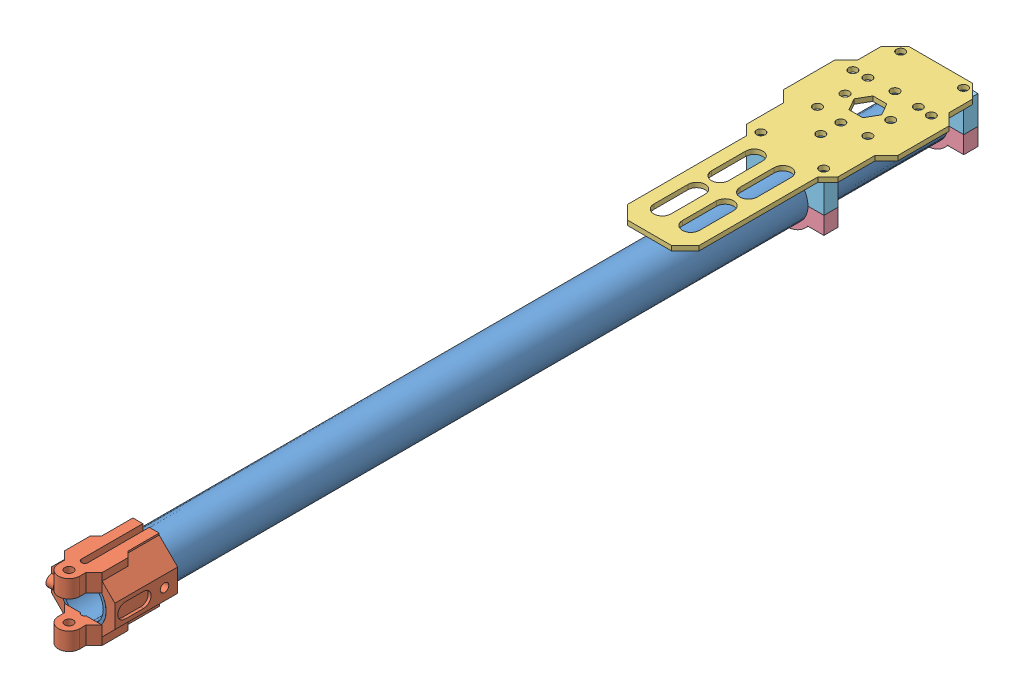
SolidWorks assembly ArmAssembly1.SLDASM, configuration Default (file format 9000). Lengths in mm.
Overall size (66.14 22.72 309.25).
7 component instances, 5 part files, 13 mates.
Components (placement in the parent):
- CarbonArm-1: CarbonArm.SLDPRT [Default] at (68.8828 85.8315 -201.8922) size (16 16 300)
- ArmCopterAttachement-2: ArmCopterAttachement.SLDPRT [Default] at (68.8828 85.8315 76.1078) x (0 1 0) z (0 0 1) size (22.14 22.14 30.75)
- Motortoarmattachement-1: Motortoarmattachement.SLDPRT [Default] at (52.8566 95.8315 -79.0445) x (0 0 1) z (-1 0 0) size (102 1.65 40)
- Lowerclamp-1: Lowerclamp.SLDPRT [Default] at (68.8828 85.8315 -152.8922) size (61.76 10 5)
- Upperclamp-1: Upperclamp.SLDPRT [Default] at (68.8828 85.8315 -152.8922) size (66.14 10 5)
- Lowerclamp-2: Lowerclamp.SLDPRT [Default] at (68.8828 85.8315 -201.8922) size (61.76 10 5)
- Upperclamp-2: Upperclamp.SLDPRT [Default] at (68.8828 85.8315 -201.8922) size (66.14 10 5)
Mates (geometry in assembly coordinates):
- Coincident2: coincident anti-aligned: plane of CarbonArm-1 through (68.8828 85.8315 99.1078) normal (0 0 1); plane of ArmCopterAttachement-2 through (68.8828 85.8315 99.1078) normal (0 0 -1)
- Concentric2: concentric aligned: cylinder of CarbonArm-1 through (68.8828 85.8315 99.1078) axis (0 0 -1) radius 8; cylinder of ArmCopterAttachement-2 through (68.8828 85.8315 99.1078) axis (0 0 -1) radius 8
- Concentric3: concentric aligned: cylinder of CarbonArm-1 through (68.8828 85.8315 99.1078) axis (0 0 -1) radius 8; cylinder of Lowerclamp-1 through (68.8828 85.8315 -147.8922) axis (0 0 -1) radius 8
- Concentric4: concentric aligned: cylinder of CarbonArm-1 through (68.8828 85.8315 99.1078) axis (0 0 -1) radius 8; cylinder of Upperclamp-1 through (68.8828 85.8315 -147.8922) axis (0 0 -1) radius 8
- Coincident5: coincident aligned: plane of Lowerclamp-1 through (68.8828 85.8315 -152.8922) normal (0 0 -1); plane of Upperclamp-1 through (68.8828 85.8315 -152.8922) normal (0 0 -1)
- Coincident7: coincident anti-aligned: plane of Lowerclamp-2 through (68.8828 85.8315 -195.8922) normal (0 1 0); plane of Upperclamp-2 through (68.8828 85.8315 -195.8922) normal (0 -1 0)
- Coincident8: coincident aligned: plane of Lowerclamp-2 through (68.8828 85.8315 -200.8922) normal (0 0 -1); plane of Upperclamp-2 through (68.8828 85.8315 -200.8922) normal (0 0 -1)
- Coincident9: coincident aligned: plane of Lowerclamp-2 through (55.2828 85.8315 -195.8922) normal (-1 0 0); plane of Upperclamp-2 through (55.2828 85.8315 -195.8922) normal (-1 0 0)
- Concentric5: concentric aligned: cylinder of CarbonArm-1 through (68.8828 85.8315 99.1078) axis (0 0 -1) radius 8; cylinder of Upperclamp-2 through (68.8828 85.8315 -195.8922) axis (0 0 -1) radius 8
- Coincident10: coincident aligned: plane of CarbonArm-1 through (68.8828 85.8315 -200.8922) normal (0 0 -1); plane of Upperclamp-2 through (68.8828 85.8315 -200.8922) normal (0 0 -1)
- Concentric8: concentric aligned: cylinder of Motortoarmattachement-1 through (57.8839 95.8315 -198.3922) axis (0 1 0) radius 1.5; cylinder of Upperclamp-2 through (57.8839 85.8315 -198.3922) axis (0 1 0) radius 1.25
- Coincident11: coincident anti-aligned: plane of Motortoarmattachement-1 through (52.8566 95.8315 -78.0445) normal (0 -1 0); plane of Upperclamp-2 through (68.8828 95.8315 -195.8922) normal (0 1 0)
- Concentric9: concentric aligned: cylinder of Motortoarmattachement-1 through (57.8839 95.8315 -150.3922) axis (0 1 0) radius 1.5; cylinder of Upperclamp-1 through (57.8839 85.8315 -150.3922) axis (0 1 0) radius 1.25
